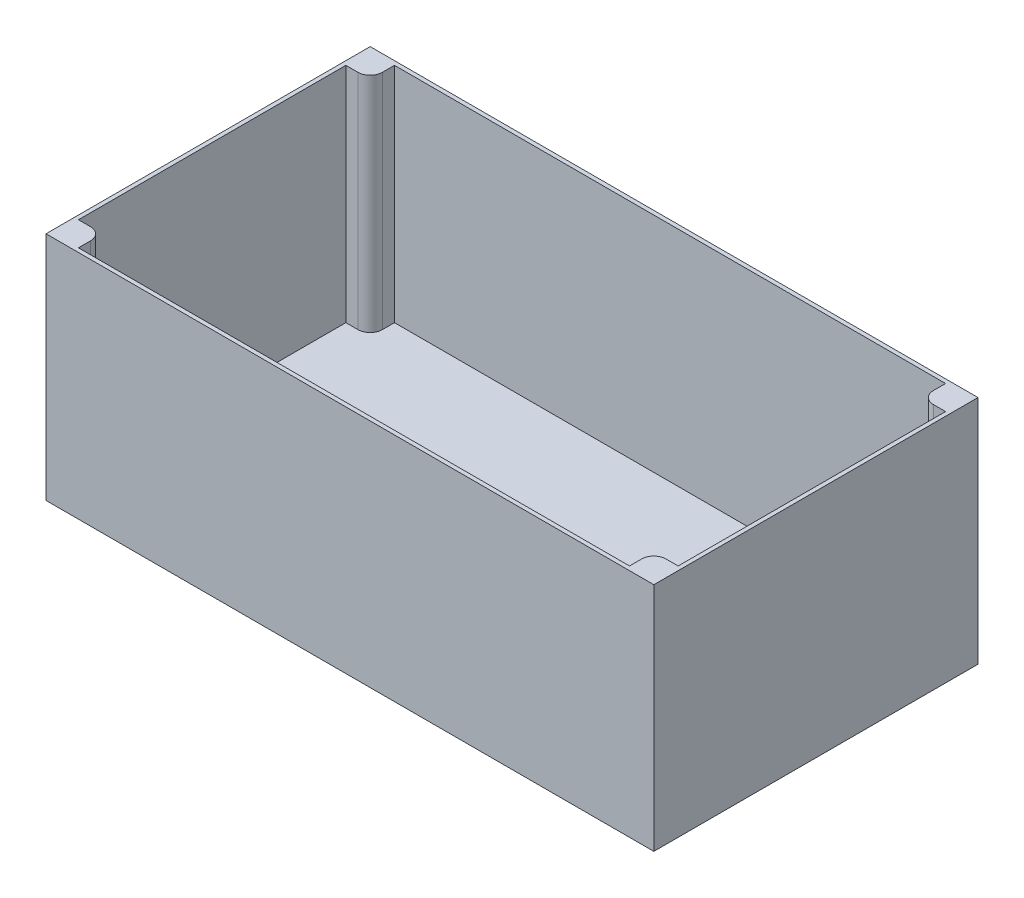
from build123d import *

# Parameters (mm, degrees)
SKETCH_1_W      = 150
SKETCH_1_H      = 80
EXTRUDE_1_DEPTH = 2
SKETCH_2_W      = 150
SKETCH_2_H      = 80
SKETCH_2_W_2    = 148
SKETCH_2_H_2    = 78
EXTRUDE_2_DEPTH = 55
SKETCH_3_W      = 6
SKETCH_3_H      = 6
EXTRUDE_3_DEPTH = 55
FILLET_1_R      = 3


with BuildPart() as part:
    # Sketch 1 → Extrude 1 (new body)
    with BuildSketch(Plane(origin=(0, 0, 0), x_dir=(1, 0, 0), z_dir=(0, 1, 0))):
        Rectangle(SKETCH_1_W, SKETCH_1_H)
    extrude(amount=EXTRUDE_1_DEPTH)

    # Sketch 2 → Extrude 2 (add)
    with BuildSketch(Plane(origin=(0, 2, 0), x_dir=(1, 0, 0), z_dir=(0, 1, 0))):
        Rectangle(SKETCH_2_W, SKETCH_2_H)
        Rectangle(SKETCH_2_W_2, SKETCH_2_H_2, mode=Mode.SUBTRACT)
    extrude(amount=EXTRUDE_2_DEPTH)

    # Sketch 3 → Extrude 3 (add)
    with BuildSketch(Plane(origin=(0, 2, 0), x_dir=(1, 0, 0), z_dir=(0, 1, 0))):
        with Locations((-71, 36)):
            Rectangle(SKETCH_3_W, SKETCH_3_H)
        with Locations((-71, -36)):
            Rectangle(SKETCH_3_W, SKETCH_3_H)
        with Locations((71, 36)):
            Rectangle(SKETCH_3_W, SKETCH_3_H)
        with Locations((71, -36)):
            Rectangle(SKETCH_3_W, SKETCH_3_H)
    extrude(amount=EXTRUDE_3_DEPTH)

    # Fillet 1
    fillet_1_edges = [part.edges().sort_by_distance(p)[0] for p in [
        (-68, 29.5, -33),
        (-68, 29.5, 33),
        (68, 29.5, -33),
        (68, 29.5, 33),
    ]]
    fillet(fillet_1_edges, radius=FILLET_1_R)


solid = part.part
